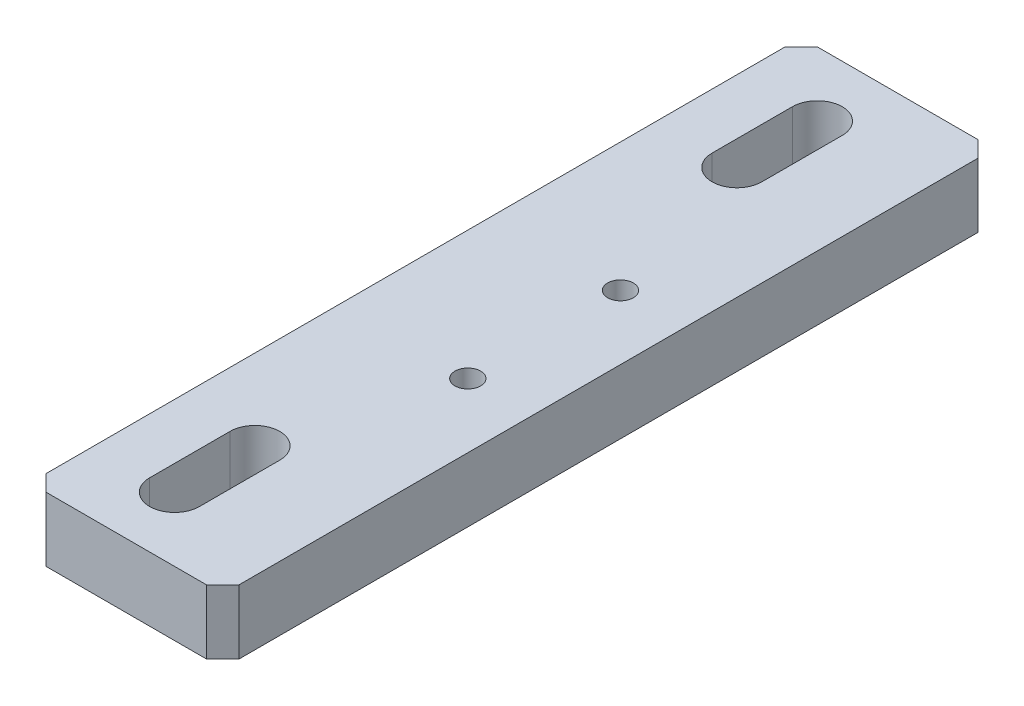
from build123d import *

# Parameters (mm, degrees)
ESQUISSE1_W        = 12
ESQUISSE1_H        = 48
BOSS_EXTRU_1_DEPTH = 4
TROU_TARAUD_M21_D  = 1.6
CHANFREIN1_SIZE    = 1


with BuildPart() as part:
    # Esquisse1 → Boss.-Extru.1 (new body)
    with BuildSketch(Plane(origin=(0, 0, 0), x_dir=(1, 0, 0), z_dir=(0, 1, 0))):
        with Locations((6, 0)):
            Rectangle(ESQUISSE1_W, ESQUISSE1_H)
        with BuildLine():
            Line((6.55, 20), (6.55, 15))
            ThreePointArc((6.55, 15), (5, 13.45), (3.45, 15))
            Line((3.45, 15), (3.45, 20))
            ThreePointArc((3.45, 20), (5, 21.55), (6.55, 20))
        make_face(mode=Mode.SUBTRACT)
        with BuildLine():
            Line((6.55, -20), (6.55, -15))
            ThreePointArc((6.55, -15), (5, -13.45), (3.45, -15))
            Line((3.45, -15), (3.45, -20))
            ThreePointArc((3.45, -20), (5, -21.55), (6.55, -20))
        make_face(mode=Mode.SUBTRACT)
    extrude(amount=BOSS_EXTRU_1_DEPTH)

    # Trou taraud_ M21 (through all)
    with Locations(Plane(origin=(0, 4, 0), x_dir=(1, 0, 0), z_dir=(0, 1, 0))):
        with Locations((8, 4.75), (8, -4.75)):
            Hole(TROU_TARAUD_M21_D / 2)

    # Chanfrein1
    chanfrein1_edges = [part.edges().sort_by_distance(p)[0] for p in [
        (0, 2, -24),
        (12, 2, -24),
        (12, 2, 24),
        (0, 2, 24),
    ]]
    chamfer(chanfrein1_edges, length=CHANFREIN1_SIZE)


solid = part.part
